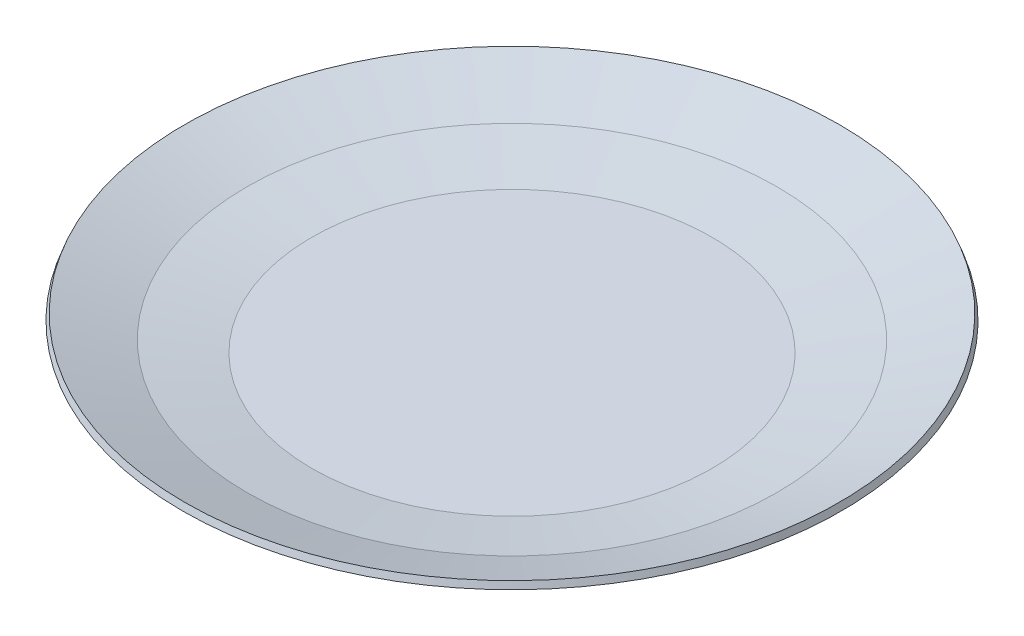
ISO-10303-21;
HEADER;
FILE_DESCRIPTION(('STEP AP214'),'2;1');
FILE_NAME('part.step','',(''),(''),'','','');
FILE_SCHEMA(('AUTOMOTIVE_DESIGN { 1 0 10303 214 1 1 1 1 }'));
ENDSEC;
DATA;
#1=APPLICATION_CONTEXT('core data for automotive mechanical design processes');
#2=APPLICATION_PROTOCOL_DEFINITION('international standard','automotive_design',2000,#1);
#3=PRODUCT_CONTEXT('',#1,'mechanical');
#4=PRODUCT('Part','Part','',(#3));
#5=PRODUCT_RELATED_PRODUCT_CATEGORY('part','',(#4));
#6=PRODUCT_DEFINITION_FORMATION('','',#4);
#7=PRODUCT_DEFINITION_CONTEXT('part definition',#1,'design');
#8=PRODUCT_DEFINITION('design','',#6,#7);
#9=PRODUCT_DEFINITION_SHAPE('','',#8);
#10=(LENGTH_UNIT() NAMED_UNIT(*) SI_UNIT(.MILLI.,.METRE.));
#11=(NAMED_UNIT(*) PLANE_ANGLE_UNIT() SI_UNIT($,.RADIAN.));
#12=(NAMED_UNIT(*) SI_UNIT($,.STERADIAN.) SOLID_ANGLE_UNIT());
#13=UNCERTAINTY_MEASURE_WITH_UNIT(LENGTH_MEASURE(1.E-05),#10,'distance_accuracy_value','');
#14=(GEOMETRIC_REPRESENTATION_CONTEXT(3) GLOBAL_UNCERTAINTY_ASSIGNED_CONTEXT((#13)) GLOBAL_UNIT_ASSIGNED_CONTEXT((#10,
#11,#12)) REPRESENTATION_CONTEXT('',''));
#15=CARTESIAN_POINT('',(0.,0.,0.));
#16=DIRECTION('',(0.,0.,1.));
#17=DIRECTION('',(1.,0.,0.));
#18=AXIS2_PLACEMENT_3D('',#15,#16,#17);
#19=CARTESIAN_POINT('',(0.,2.70609728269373,0.));
#20=DIRECTION('',(0.,1.,0.));
#21=DIRECTION('',(0.,0.,1.));
#22=AXIS2_PLACEMENT_3D('',#19,#20,#21);
#23=TOROIDAL_SURFACE('',#22,39.5882698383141,1.);
#24=CARTESIAN_POINT('',(0.,1.72128952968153,0.));
#25=DIRECTION('',(0.,1.,0.));
#26=DIRECTION('',(0.,0.,1.));
#27=AXIS2_PLACEMENT_3D('',#24,#25,#26);
#28=CIRCLE('',#27,39.7619180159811);
#29=CARTESIAN_POINT('',(0.,1.72128952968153,39.7619180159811));
#30=VERTEX_POINT('',#29);
#31=EDGE_CURVE('E59',#30,#30,#28,.T.);
#32=ORIENTED_EDGE('',*,*,#31,.T.);
#33=EDGE_LOOP('',(#32));
#34=FACE_BOUND('',#33,.T.);
#35=CARTESIAN_POINT('',(0.,1.76640466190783,0.));
#36=DIRECTION('',(0.,1.,0.));
#37=DIRECTION('',(0.,0.,1.));
#38=AXIS2_PLACEMENT_3D('',#35,#36,#37);
#39=CIRCLE('',#38,39.9302899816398);
#40=CARTESIAN_POINT('',(0.,1.76640466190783,39.9302899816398));
#41=VERTEX_POINT('',#40);
#42=EDGE_CURVE('E10',#41,#41,#39,.T.);
#43=ORIENTED_EDGE('',*,*,#42,.F.);
#44=EDGE_LOOP('',(#43));
#45=FACE_BOUND('',#44,.T.);
#46=ADVANCED_FACE('F31',(#34,#45),#23,.T.);
#47=CARTESIAN_POINT('',(0.,1.76640466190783,0.));
#48=DIRECTION('',(0.,1.,0.));
#49=DIRECTION('',(0.,0.,1.));
#50=AXIS2_PLACEMENT_3D('',#47,#48,#49);
#51=CONICAL_SURFACE('',#50,39.9302899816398,1.22173047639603);
#52=CARTESIAN_POINT('',(0.,5.15668320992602,0.));
#53=DIRECTION('',(0.,1.,0.));
#54=DIRECTION('',(0.,0.,1.));
#55=AXIS2_PLACEMENT_3D('',#52,#53,#54);
#56=CIRCLE('',#55,49.2450037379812);
#57=CARTESIAN_POINT('',(0.,5.15668320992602,49.2450037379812));
#58=VERTEX_POINT('',#57);
#59=EDGE_CURVE('E37',#58,#58,#56,.T.);
#60=ORIENTED_EDGE('',*,*,#59,.F.);
#61=EDGE_LOOP('',(#60));
#62=FACE_BOUND('',#61,.T.);
#63=ORIENTED_EDGE('',*,*,#42,.T.);
#64=EDGE_LOOP('',(#63));
#65=FACE_BOUND('',#64,.T.);
#66=ADVANCED_FACE('F83',(#62,#65),#51,.T.);
#67=CARTESIAN_POINT('',(0.,6.09637583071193,0.));
#68=DIRECTION('',(0.,-1.,0.));
#69=DIRECTION('',(0.,0.,-1.));
#70=AXIS2_PLACEMENT_3D('',#67,#68,#69);
#71=CONICAL_SURFACE('',#70,48.9029835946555,0.349065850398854);
#72=ORIENTED_EDGE('',*,*,#59,.T.);
#73=EDGE_LOOP('',(#72));
#74=FACE_BOUND('',#73,.T.);
#75=CARTESIAN_POINT('',(0.,6.09637583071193,0.));
#76=DIRECTION('',(0.,1.,0.));
#77=DIRECTION('',(0.,0.,1.));
#78=AXIS2_PLACEMENT_3D('',#75,#76,#77);
#79=CIRCLE('',#78,48.9029835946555);
#80=CARTESIAN_POINT('',(0.,6.09637583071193,48.9029835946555));
#81=VERTEX_POINT('',#80);
#82=EDGE_CURVE('E41',#81,#81,#79,.T.);
#83=ORIENTED_EDGE('',*,*,#82,.F.);
#84=EDGE_LOOP('',(#83));
#85=FACE_BOUND('',#84,.T.);
#86=ADVANCED_FACE('F87',(#74,#85),#71,.T.);
#87=CARTESIAN_POINT('',(0.,2.70609728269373,0.));
#88=DIRECTION('',(0.,1.,0.));
#89=DIRECTION('',(0.,0.,1.));
#90=AXIS2_PLACEMENT_3D('',#87,#88,#89);
#91=CONICAL_SURFACE('',#90,39.5882698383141,1.22173047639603);
#92=ORIENTED_EDGE('',*,*,#82,.T.);
#93=EDGE_LOOP('',(#92));
#94=FACE_BOUND('',#93,.T.);
#95=CARTESIAN_POINT('',(0.,2.70609728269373,0.));
#96=DIRECTION('',(0.,1.,0.));
#97=DIRECTION('',(0.,0.,1.));
#98=AXIS2_PLACEMENT_3D('',#95,#96,#97);
#99=CIRCLE('',#98,39.5882698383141);
#100=CARTESIAN_POINT('',(0.,2.70609728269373,39.5882698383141));
#101=VERTEX_POINT('',#100);
#102=EDGE_CURVE('E45',#101,#101,#99,.T.);
#103=ORIENTED_EDGE('',*,*,#102,.F.);
#104=EDGE_LOOP('',(#103));
#105=FACE_BOUND('',#104,.T.);
#106=ADVANCED_FACE('F92',(#94,#105),#91,.F.);
#107=CARTESIAN_POINT('',(0.,1.,0.));
#108=DIRECTION('',(0.,1.,0.));
#109=DIRECTION('',(0.,0.,1.));
#110=AXIS2_PLACEMENT_3D('',#107,#108,#109);
#111=CONICAL_SURFACE('',#110,29.9125113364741,1.39626340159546);
#112=ORIENTED_EDGE('',*,*,#102,.T.);
#113=EDGE_LOOP('',(#112));
#114=FACE_BOUND('',#113,.T.);
#115=CARTESIAN_POINT('',(0.,1.,0.));
#116=DIRECTION('',(0.,1.,0.));
#117=DIRECTION('',(0.,0.,1.));
#118=AXIS2_PLACEMENT_3D('',#115,#116,#117);
#119=CIRCLE('',#118,29.9125113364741);
#120=CARTESIAN_POINT('',(0.,1.,29.9125113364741));
#121=VERTEX_POINT('',#120);
#122=EDGE_CURVE('E50',#121,#121,#119,.T.);
#123=ORIENTED_EDGE('',*,*,#122,.F.);
#124=EDGE_LOOP('',(#123));
#125=FACE_BOUND('',#124,.T.);
#126=ADVANCED_FACE('F97',(#114,#125),#111,.F.);
#127=CARTESIAN_POINT('',(24.6225018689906,1.,0.));
#128=DIRECTION('',(0.,1.,0.));
#129=DIRECTION('',(0.,0.,1.));
#130=AXIS2_PLACEMENT_3D('',#127,#128,#129);
#131=PLANE('',#130);
#132=ORIENTED_EDGE('',*,*,#122,.T.);
#133=EDGE_LOOP('',(#132));
#134=FACE_BOUND('',#133,.T.);
#135=ADVANCED_FACE('F79',(#134),#131,.T.);
#136=CARTESIAN_POINT('',(24.6225018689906,0.,0.));
#137=DIRECTION('',(0.,1.,0.));
#138=DIRECTION('',(0.,0.,1.));
#139=AXIS2_PLACEMENT_3D('',#136,#137,#138);
#140=PLANE('',#139);
#141=CARTESIAN_POINT('',(0.,0.,0.));
#142=DIRECTION('',(0.,1.,0.));
#143=DIRECTION('',(0.,0.,1.));
#144=AXIS2_PLACEMENT_3D('',#141,#142,#143);
#145=CIRCLE('',#144,29.9125113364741);
#146=CARTESIAN_POINT('',(0.,0.,29.9125113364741));
#147=VERTEX_POINT('',#146);
#148=EDGE_CURVE('E53',#147,#147,#145,.T.);
#149=ORIENTED_EDGE('',*,*,#148,.F.);
#150=EDGE_LOOP('',(#149));
#151=FACE_BOUND('',#150,.T.);
#152=ADVANCED_FACE('F73',(#151),#140,.F.);
#153=CARTESIAN_POINT('',(0.,1.,0.));
#154=DIRECTION('',(0.,1.,0.));
#155=DIRECTION('',(0.,0.,1.));
#156=AXIS2_PLACEMENT_3D('',#153,#154,#155);
#157=TOROIDAL_SURFACE('',#156,29.9125113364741,1.);
#158=ORIENTED_EDGE('',*,*,#148,.T.);
#159=EDGE_LOOP('',(#158));
#160=FACE_BOUND('',#159,.T.);
#161=CARTESIAN_POINT('',(0.,0.0151922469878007,0.));
#162=DIRECTION('',(0.,1.,0.));
#163=DIRECTION('',(0.,0.,1.));
#164=AXIS2_PLACEMENT_3D('',#161,#162,#163);
#165=CIRCLE('',#164,30.086159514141);
#166=CARTESIAN_POINT('',(0.,0.0151922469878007,30.086159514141));
#167=VERTEX_POINT('',#166);
#168=EDGE_CURVE('E56',#167,#167,#165,.T.);
#169=ORIENTED_EDGE('',*,*,#168,.F.);
#170=EDGE_LOOP('',(#169));
#171=FACE_BOUND('',#170,.T.);
#172=ADVANCED_FACE('F68',(#160,#171),#157,.T.);
#173=CARTESIAN_POINT('',(0.,0.0151922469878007,0.));
#174=DIRECTION('',(0.,1.,0.));
#175=DIRECTION('',(0.,0.,1.));
#176=AXIS2_PLACEMENT_3D('',#173,#174,#175);
#177=CONICAL_SURFACE('',#176,30.086159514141,1.39626340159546);
#178=ORIENTED_EDGE('',*,*,#31,.F.);
#179=EDGE_LOOP('',(#178));
#180=FACE_BOUND('',#179,.T.);
#181=ORIENTED_EDGE('',*,*,#168,.T.);
#182=EDGE_LOOP('',(#181));
#183=FACE_BOUND('',#182,.T.);
#184=ADVANCED_FACE('F65',(#180,#183),#177,.T.);
#185=CLOSED_SHELL('',(#46,#66,#86,#106,#126,#135,#152,#172,#184));
#186=MANIFOLD_SOLID_BREP('B2',#185);
#187=ADVANCED_BREP_SHAPE_REPRESENTATION('',(#18,#186),#14);
#188=SHAPE_DEFINITION_REPRESENTATION(#9,#187);
ENDSEC;
END-ISO-10303-21;
